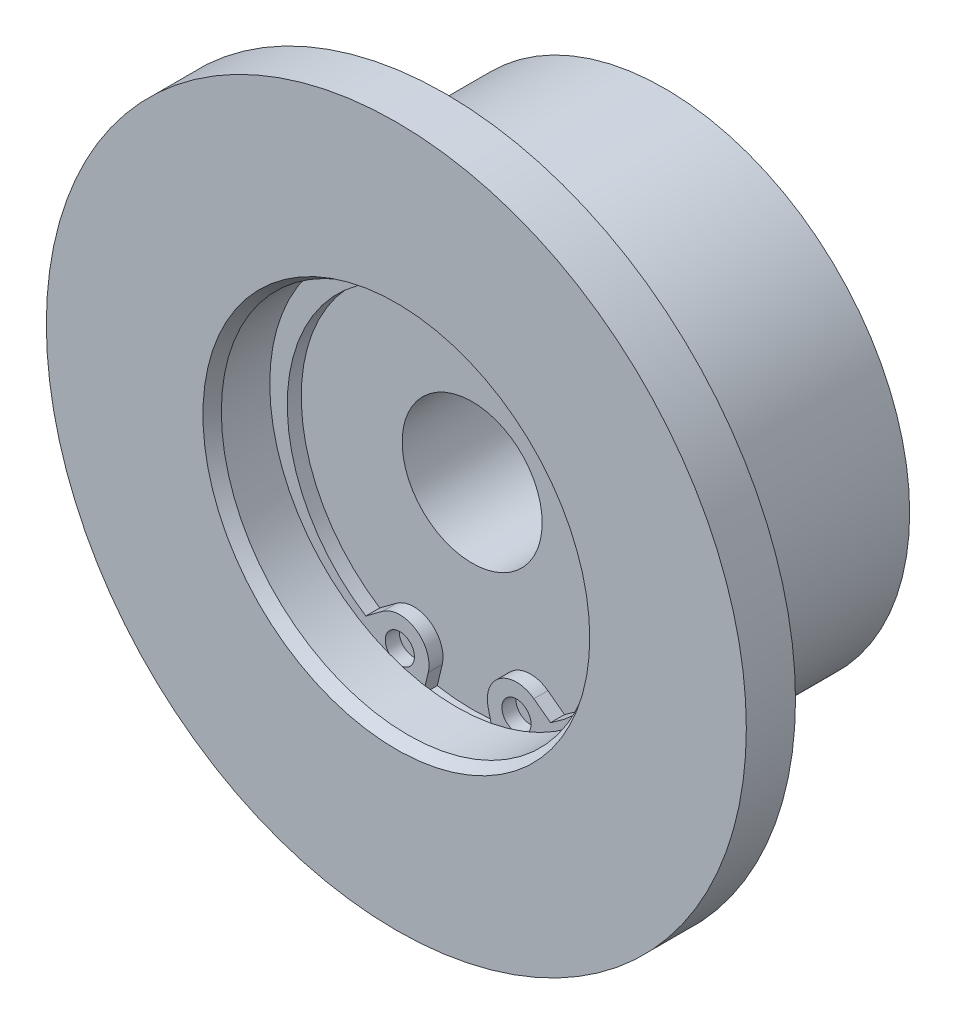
ISO-10303-21;
HEADER;
FILE_DESCRIPTION(('STEP AP214'),'2;1');
FILE_NAME('part.step','',(''),(''),'','','');
FILE_SCHEMA(('AUTOMOTIVE_DESIGN { 1 0 10303 214 1 1 1 1 }'));
ENDSEC;
DATA;
#1=APPLICATION_CONTEXT('core data for automotive mechanical design processes');
#2=APPLICATION_PROTOCOL_DEFINITION('international standard','automotive_design',2000,#1);
#3=PRODUCT_CONTEXT('',#1,'mechanical');
#4=PRODUCT('Part','Part','',(#3));
#5=PRODUCT_RELATED_PRODUCT_CATEGORY('part','',(#4));
#6=PRODUCT_DEFINITION_FORMATION('','',#4);
#7=PRODUCT_DEFINITION_CONTEXT('part definition',#1,'design');
#8=PRODUCT_DEFINITION('design','',#6,#7);
#9=PRODUCT_DEFINITION_SHAPE('','',#8);
#10=(LENGTH_UNIT() NAMED_UNIT(*) SI_UNIT(.MILLI.,.METRE.));
#11=(NAMED_UNIT(*) PLANE_ANGLE_UNIT() SI_UNIT($,.RADIAN.));
#12=(NAMED_UNIT(*) SI_UNIT($,.STERADIAN.) SOLID_ANGLE_UNIT());
#13=UNCERTAINTY_MEASURE_WITH_UNIT(LENGTH_MEASURE(1.E-05),#10,'distance_accuracy_value','');
#14=(GEOMETRIC_REPRESENTATION_CONTEXT(3) GLOBAL_UNCERTAINTY_ASSIGNED_CONTEXT((#13)) GLOBAL_UNIT_ASSIGNED_CONTEXT((#10,
#11,#12)) REPRESENTATION_CONTEXT('',''));
#15=CARTESIAN_POINT('',(0.,0.,0.));
#16=DIRECTION('',(0.,0.,1.));
#17=DIRECTION('',(1.,0.,0.));
#18=AXIS2_PLACEMENT_3D('',#15,#16,#17);
#19=CARTESIAN_POINT('',(0.,-0.95,6.2));
#20=DIRECTION('',(0.,0.,1.));
#21=DIRECTION('',(-1.,0.,0.));
#22=AXIS2_PLACEMENT_3D('',#19,#20,#21);
#23=CYLINDRICAL_SURFACE('',#22,14.65);
#24=CARTESIAN_POINT('',(0.,-0.95,5.));
#25=DIRECTION('',(0.,0.,-1.));
#26=DIRECTION('',(0.,-1.,0.));
#27=AXIS2_PLACEMENT_3D('',#24,#25,#26);
#28=CIRCLE('',#27,14.65);
#29=CARTESIAN_POINT('',(-7.91695293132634,-13.2765711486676,5.));
#30=VERTEX_POINT('',#29);
#31=CARTESIAN_POINT('',(7.91695293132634,-13.2765711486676,5.));
#32=VERTEX_POINT('',#31);
#33=EDGE_CURVE('E161',#30,#32,#28,.T.);
#34=ORIENTED_EDGE('',*,*,#33,.T.);
#35=DIRECTION('',(0.,0.,-1.));
#36=VECTOR('',#35,1.);
#37=CARTESIAN_POINT('',(7.91695293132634,-13.2765711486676,6.2));
#38=LINE('',#37,#36);
#39=CARTESIAN_POINT('',(7.91695293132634,-13.2765711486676,6.2));
#40=VERTEX_POINT('',#39);
#41=EDGE_CURVE('E101',#40,#32,#38,.T.);
#42=ORIENTED_EDGE('',*,*,#41,.F.);
#43=CARTESIAN_POINT('',(0.,-0.95,6.2));
#44=DIRECTION('',(0.,0.,-1.));
#45=DIRECTION('',(0.,-1.,0.));
#46=AXIS2_PLACEMENT_3D('',#43,#44,#45);
#47=CIRCLE('',#46,14.65);
#48=CARTESIAN_POINT('',(-7.91695293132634,-13.2765711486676,6.2));
#49=VERTEX_POINT('',#48);
#50=EDGE_CURVE('E102',#49,#40,#47,.T.);
#51=ORIENTED_EDGE('',*,*,#50,.F.);
#52=DIRECTION('',(0.,0.,-1.));
#53=VECTOR('',#52,1.);
#54=CARTESIAN_POINT('',(-7.91695293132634,-13.2765711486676,6.2));
#55=LINE('',#54,#53);
#56=EDGE_CURVE('E96',#49,#30,#55,.T.);
#57=ORIENTED_EDGE('',*,*,#56,.T.);
#58=EDGE_LOOP('',(#34,#42,#51,#57));
#59=FACE_BOUND('',#58,.T.);
#60=ADVANCED_FACE('F14',(#59),#23,.F.);
#61=CARTESIAN_POINT('',(6.49138441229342,-12.2169439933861,6.2));
#62=DIRECTION('',(-0.596553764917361,-0.802573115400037,0.));
#63=DIRECTION('',(-0.802573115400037,0.596553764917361,0.));
#64=AXIS2_PLACEMENT_3D('',#61,#62,#63);
#65=PLANE('',#64);
#66=DIRECTION('',(-0.802573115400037,0.596553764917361,0.));
#67=VECTOR('',#66,1.);
#68=CARTESIAN_POINT('',(6.49138441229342,-12.2169439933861,5.));
#69=LINE('',#68,#67);
#70=CARTESIAN_POINT('',(6.49138441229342,-12.2169439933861,5.));
#71=VERTEX_POINT('',#70);
#72=EDGE_CURVE('E145',#32,#71,#69,.T.);
#73=ORIENTED_EDGE('',*,*,#72,.T.);
#74=DIRECTION('',(0.,0.,-1.));
#75=VECTOR('',#74,1.);
#76=CARTESIAN_POINT('',(6.49138441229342,-12.2169439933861,6.2));
#77=LINE('',#76,#75);
#78=CARTESIAN_POINT('',(6.49138441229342,-12.2169439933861,6.2));
#79=VERTEX_POINT('',#78);
#80=EDGE_CURVE('E150',#79,#71,#77,.T.);
#81=ORIENTED_EDGE('',*,*,#80,.F.);
#82=DIRECTION('',(-0.802573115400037,0.596553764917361,0.));
#83=VECTOR('',#82,1.);
#84=CARTESIAN_POINT('',(6.49138441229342,-12.2169439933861,6.2));
#85=LINE('',#84,#83);
#86=EDGE_CURVE('E135',#40,#79,#85,.T.);
#87=ORIENTED_EDGE('',*,*,#86,.F.);
#88=ORIENTED_EDGE('',*,*,#41,.T.);
#89=EDGE_LOOP('',(#73,#81,#87,#88));
#90=FACE_BOUND('',#89,.T.);
#91=ADVANCED_FACE('F286',(#90),#65,.F.);
#92=CARTESIAN_POINT('',(5.,-14.2233767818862,6.2));
#93=DIRECTION('',(0.,0.,1.));
#94=DIRECTION('',(-1.,0.,0.));
#95=AXIS2_PLACEMENT_3D('',#92,#93,#94);
#96=CYLINDRICAL_SURFACE('',#95,2.5);
#97=CARTESIAN_POINT('',(5.,-14.2233767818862,5.));
#98=DIRECTION('',(0.,0.,1.));
#99=DIRECTION('',(1.,0.,0.));
#100=AXIS2_PLACEMENT_3D('',#97,#98,#99);
#101=CIRCLE('',#100,2.5);
#102=CARTESIAN_POINT('',(2.5678231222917,-14.8017500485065,5.));
#103=VERTEX_POINT('',#102);
#104=EDGE_CURVE('E131',#71,#103,#101,.T.);
#105=ORIENTED_EDGE('',*,*,#104,.T.);
#106=DIRECTION('',(0.,0.,-1.));
#107=VECTOR('',#106,1.);
#108=CARTESIAN_POINT('',(2.5678231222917,-14.8017500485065,6.2));
#109=LINE('',#108,#107);
#110=CARTESIAN_POINT('',(2.5678231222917,-14.8017500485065,6.2));
#111=VERTEX_POINT('',#110);
#112=EDGE_CURVE('E151',#111,#103,#109,.T.);
#113=ORIENTED_EDGE('',*,*,#112,.F.);
#114=CARTESIAN_POINT('',(5.,-14.2233767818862,6.2));
#115=DIRECTION('',(0.,0.,1.));
#116=DIRECTION('',(1.,0.,0.));
#117=AXIS2_PLACEMENT_3D('',#114,#115,#116);
#118=CIRCLE('',#117,2.5);
#119=EDGE_CURVE('E166',#79,#111,#118,.T.);
#120=ORIENTED_EDGE('',*,*,#119,.F.);
#121=ORIENTED_EDGE('',*,*,#80,.T.);
#122=EDGE_LOOP('',(#105,#113,#120,#121));
#123=FACE_BOUND('',#122,.T.);
#124=ADVANCED_FACE('F283',(#123),#96,.T.);
#125=CARTESIAN_POINT('',(-2.56782312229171,-14.8017500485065,6.2));
#126=DIRECTION('',(-0.97287075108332,0.231349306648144,0.));
#127=DIRECTION('',(0.,0.,1.));
#128=AXIS2_PLACEMENT_3D('',#125,#126,#127);
#129=PLANE('',#128);
#130=DIRECTION('',(0.,0.,1.));
#131=VECTOR('',#130,1.);
#132=CARTESIAN_POINT('',(-2.99125499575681,-16.5823669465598,20.1183293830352));
#133=LINE('',#132,#131);
#134=CARTESIAN_POINT('',(-2.99125499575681,-16.5823669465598,5.));
#135=VERTEX_POINT('',#134);
#136=CARTESIAN_POINT('',(-2.99125499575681,-16.5823669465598,6.2));
#137=VERTEX_POINT('',#136);
#138=EDGE_CURVE('E175',#135,#137,#133,.T.);
#139=ORIENTED_EDGE('',*,*,#138,.F.);
#140=DIRECTION('',(0.231349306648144,0.97287075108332,0.));
#141=VECTOR('',#140,1.);
#142=CARTESIAN_POINT('',(-2.56782312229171,-14.8017500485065,5.));
#143=LINE('',#142,#141);
#144=CARTESIAN_POINT('',(-2.56782312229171,-14.8017500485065,5.));
#145=VERTEX_POINT('',#144);
#146=EDGE_CURVE('E152',#135,#145,#143,.T.);
#147=ORIENTED_EDGE('',*,*,#146,.T.);
#148=DIRECTION('',(0.,0.,-1.));
#149=VECTOR('',#148,1.);
#150=CARTESIAN_POINT('',(-2.56782312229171,-14.8017500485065,6.2));
#151=LINE('',#150,#149);
#152=CARTESIAN_POINT('',(-2.56782312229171,-14.8017500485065,6.2));
#153=VERTEX_POINT('',#152);
#154=EDGE_CURVE('E171',#153,#145,#151,.T.);
#155=ORIENTED_EDGE('',*,*,#154,.F.);
#156=DIRECTION('',(0.231349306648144,0.97287075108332,0.));
#157=VECTOR('',#156,1.);
#158=CARTESIAN_POINT('',(-2.56782312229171,-14.8017500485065,6.2));
#159=LINE('',#158,#157);
#160=EDGE_CURVE('E119',#137,#153,#159,.T.);
#161=ORIENTED_EDGE('',*,*,#160,.F.);
#162=EDGE_LOOP('',(#139,#147,#155,#161));
#163=FACE_BOUND('',#162,.T.);
#164=ADVANCED_FACE('F296',(#163),#129,.F.);
#165=CARTESIAN_POINT('',(0.,-0.95,6.2));
#166=DIRECTION('',(0.,0.,-1.));
#167=DIRECTION('',(0.,-1.,0.));
#168=AXIS2_PLACEMENT_3D('',#165,#166,#167);
#169=PLANE('',#168);
#170=CARTESIAN_POINT('',(5.,-14.2233767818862,6.2));
#171=DIRECTION('',(0.,0.,1.));
#172=DIRECTION('',(1.,0.,0.));
#173=AXIS2_PLACEMENT_3D('',#170,#171,#172);
#174=CIRCLE('',#173,1.25);
#175=CARTESIAN_POINT('',(6.25,-14.2233767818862,6.2));
#176=VERTEX_POINT('',#175);
#177=EDGE_CURVE('E137',#176,#176,#174,.T.);
#178=ORIENTED_EDGE('',*,*,#177,.F.);
#179=EDGE_LOOP('',(#178));
#180=FACE_BOUND('',#179,.T.);
#181=CARTESIAN_POINT('',(-5.,-14.2233767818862,6.2));
#182=DIRECTION('',(0.,0.,-1.));
#183=DIRECTION('',(1.,0.,0.));
#184=AXIS2_PLACEMENT_3D('',#181,#182,#183);
#185=CIRCLE('',#184,1.25);
#186=CARTESIAN_POINT('',(-3.75,-14.2233767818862,6.2));
#187=VERTEX_POINT('',#186);
#188=EDGE_CURVE('E121',#187,#187,#185,.T.);
#189=ORIENTED_EDGE('',*,*,#188,.T.);
#190=EDGE_LOOP('',(#189));
#191=FACE_BOUND('',#190,.T.);
#192=CARTESIAN_POINT('',(0.,0.,6.2));
#193=DIRECTION('',(0.,0.,-1.));
#194=DIRECTION('',(-1.,0.,0.));
#195=AXIS2_PLACEMENT_3D('',#192,#193,#194);
#196=CIRCLE('',#195,16.85);
#197=CARTESIAN_POINT('',(2.99125499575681,-16.5823669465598,6.2));
#198=VERTEX_POINT('',#197);
#199=EDGE_CURVE('E9',#137,#198,#196,.T.);
#200=ORIENTED_EDGE('',*,*,#199,.F.);
#201=ORIENTED_EDGE('',*,*,#160,.T.);
#202=CARTESIAN_POINT('',(-5.,-14.2233767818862,6.2));
#203=DIRECTION('',(0.,0.,1.));
#204=DIRECTION('',(-1.,0.,0.));
#205=AXIS2_PLACEMENT_3D('',#202,#203,#204);
#206=CIRCLE('',#205,2.5);
#207=CARTESIAN_POINT('',(-6.49138441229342,-12.2169439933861,6.2));
#208=VERTEX_POINT('',#207);
#209=EDGE_CURVE('E108',#153,#208,#206,.T.);
#210=ORIENTED_EDGE('',*,*,#209,.T.);
#211=DIRECTION('',(-0.802573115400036,-0.596553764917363,0.));
#212=VECTOR('',#211,1.);
#213=CARTESIAN_POINT('',(-6.49138441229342,-12.2169439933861,6.2));
#214=LINE('',#213,#212);
#215=EDGE_CURVE('E91',#208,#49,#214,.T.);
#216=ORIENTED_EDGE('',*,*,#215,.T.);
#217=ORIENTED_EDGE('',*,*,#50,.T.);
#218=ORIENTED_EDGE('',*,*,#86,.T.);
#219=ORIENTED_EDGE('',*,*,#119,.T.);
#220=DIRECTION('',(0.231349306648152,-0.972870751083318,0.));
#221=VECTOR('',#220,1.);
#222=CARTESIAN_POINT('',(2.5678231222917,-14.8017500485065,6.2));
#223=LINE('',#222,#221);
#224=EDGE_CURVE('E127',#111,#198,#223,.T.);
#225=ORIENTED_EDGE('',*,*,#224,.T.);
#226=EDGE_LOOP('',(#200,#201,#210,#216,#217,#218,#219,#225));
#227=FACE_BOUND('',#226,.T.);
#228=ADVANCED_FACE('F117',(#180,#191,#227),#169,.F.);
#229=CARTESIAN_POINT('',(5.,-14.2233767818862,6.2));
#230=DIRECTION('',(0.,0.,1.));
#231=DIRECTION('',(-1.,0.,0.));
#232=AXIS2_PLACEMENT_3D('',#229,#230,#231);
#233=CYLINDRICAL_SURFACE('',#232,1.25);
#234=CARTESIAN_POINT('',(5.,-14.2233767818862,5.));
#235=DIRECTION('',(0.,0.,1.));
#236=DIRECTION('',(1.,0.,0.));
#237=AXIS2_PLACEMENT_3D('',#234,#235,#236);
#238=CIRCLE('',#237,1.25);
#239=CARTESIAN_POINT('',(6.25,-14.2233767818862,5.));
#240=VERTEX_POINT('',#239);
#241=EDGE_CURVE('E114',#240,#240,#238,.T.);
#242=ORIENTED_EDGE('',*,*,#241,.F.);
#243=EDGE_LOOP('',(#242));
#244=FACE_BOUND('',#243,.T.);
#245=ORIENTED_EDGE('',*,*,#177,.T.);
#246=EDGE_LOOP('',(#245));
#247=FACE_BOUND('',#246,.T.);
#248=ADVANCED_FACE('F304',(#244,#247),#233,.F.);
#249=CARTESIAN_POINT('',(-5.,-14.2233767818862,6.2));
#250=DIRECTION('',(0.,0.,1.));
#251=DIRECTION('',(-1.,0.,0.));
#252=AXIS2_PLACEMENT_3D('',#249,#250,#251);
#253=CYLINDRICAL_SURFACE('',#252,1.25);
#254=CARTESIAN_POINT('',(-5.,-14.2233767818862,5.));
#255=DIRECTION('',(0.,0.,-1.));
#256=DIRECTION('',(1.,0.,0.));
#257=AXIS2_PLACEMENT_3D('',#254,#255,#256);
#258=CIRCLE('',#257,1.25);
#259=CARTESIAN_POINT('',(-3.75,-14.2233767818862,5.));
#260=VERTEX_POINT('',#259);
#261=EDGE_CURVE('E140',#260,#260,#258,.T.);
#262=ORIENTED_EDGE('',*,*,#261,.T.);
#263=EDGE_LOOP('',(#262));
#264=FACE_BOUND('',#263,.T.);
#265=ORIENTED_EDGE('',*,*,#188,.F.);
#266=EDGE_LOOP('',(#265));
#267=FACE_BOUND('',#266,.T.);
#268=ADVANCED_FACE('F326',(#264,#267),#253,.F.);
#269=CARTESIAN_POINT('',(-6.49138441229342,-12.2169439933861,6.2));
#270=DIRECTION('',(0.596553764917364,-0.802573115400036,0.));
#271=DIRECTION('',(0.,0.,-1.));
#272=AXIS2_PLACEMENT_3D('',#269,#270,#271);
#273=PLANE('',#272);
#274=DIRECTION('',(-0.802573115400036,-0.596553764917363,0.));
#275=VECTOR('',#274,1.);
#276=CARTESIAN_POINT('',(-6.49138441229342,-12.2169439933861,5.));
#277=LINE('',#276,#275);
#278=CARTESIAN_POINT('',(-6.49138441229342,-12.2169439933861,5.));
#279=VERTEX_POINT('',#278);
#280=EDGE_CURVE('E113',#279,#30,#277,.T.);
#281=ORIENTED_EDGE('',*,*,#280,.T.);
#282=ORIENTED_EDGE('',*,*,#56,.F.);
#283=ORIENTED_EDGE('',*,*,#215,.F.);
#284=DIRECTION('',(0.,0.,-1.));
#285=VECTOR('',#284,1.);
#286=CARTESIAN_POINT('',(-6.49138441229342,-12.2169439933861,6.2));
#287=LINE('',#286,#285);
#288=EDGE_CURVE('E94',#208,#279,#287,.T.);
#289=ORIENTED_EDGE('',*,*,#288,.T.);
#290=EDGE_LOOP('',(#281,#282,#283,#289));
#291=FACE_BOUND('',#290,.T.);
#292=ADVANCED_FACE('F93',(#291),#273,.F.);
#293=CARTESIAN_POINT('',(-5.,-14.2233767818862,6.2));
#294=DIRECTION('',(0.,0.,1.));
#295=DIRECTION('',(-1.,0.,0.));
#296=AXIS2_PLACEMENT_3D('',#293,#294,#295);
#297=CYLINDRICAL_SURFACE('',#296,2.5);
#298=CARTESIAN_POINT('',(-5.,-14.2233767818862,5.));
#299=DIRECTION('',(0.,0.,1.));
#300=DIRECTION('',(-1.,0.,0.));
#301=AXIS2_PLACEMENT_3D('',#298,#299,#300);
#302=CIRCLE('',#301,2.5);
#303=EDGE_CURVE('E110',#145,#279,#302,.T.);
#304=ORIENTED_EDGE('',*,*,#303,.T.);
#305=ORIENTED_EDGE('',*,*,#288,.F.);
#306=ORIENTED_EDGE('',*,*,#209,.F.);
#307=ORIENTED_EDGE('',*,*,#154,.T.);
#308=EDGE_LOOP('',(#304,#305,#306,#307));
#309=FACE_BOUND('',#308,.T.);
#310=ADVANCED_FACE('F106',(#309),#297,.T.);
#311=CARTESIAN_POINT('',(2.5678231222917,-14.8017500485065,6.2));
#312=DIRECTION('',(0.972870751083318,0.231349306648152,0.));
#313=DIRECTION('',(0.,0.,-1.));
#314=AXIS2_PLACEMENT_3D('',#311,#312,#313);
#315=PLANE('',#314);
#316=DIRECTION('',(0.,0.,1.));
#317=VECTOR('',#316,1.);
#318=CARTESIAN_POINT('',(2.99125499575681,-16.5823669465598,20.1183293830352));
#319=LINE('',#318,#317);
#320=CARTESIAN_POINT('',(2.99125499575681,-16.5823669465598,5.));
#321=VERTEX_POINT('',#320);
#322=EDGE_CURVE('E18',#198,#321,#319,.F.);
#323=ORIENTED_EDGE('',*,*,#322,.F.);
#324=ORIENTED_EDGE('',*,*,#224,.F.);
#325=ORIENTED_EDGE('',*,*,#112,.T.);
#326=DIRECTION('',(0.231349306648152,-0.972870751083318,0.));
#327=VECTOR('',#326,1.);
#328=CARTESIAN_POINT('',(2.5678231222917,-14.8017500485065,5.));
#329=LINE('',#328,#327);
#330=EDGE_CURVE('E32',#103,#321,#329,.T.);
#331=ORIENTED_EDGE('',*,*,#330,.T.);
#332=EDGE_LOOP('',(#323,#324,#325,#331));
#333=FACE_BOUND('',#332,.T.);
#334=ADVANCED_FACE('F265',(#333),#315,.F.);
#335=CARTESIAN_POINT('',(0.,6.,5.));
#336=DIRECTION('',(0.,0.,-1.));
#337=DIRECTION('',(-1.,0.,0.));
#338=AXIS2_PLACEMENT_3D('',#335,#336,#337);
#339=PLANE('',#338);
#340=ORIENTED_EDGE('',*,*,#241,.T.);
#341=EDGE_LOOP('',(#340));
#342=FACE_BOUND('',#341,.T.);
#343=ADVANCED_FACE('F257',(#342),#339,.F.);
#344=ORIENTED_EDGE('',*,*,#261,.F.);
#345=EDGE_LOOP('',(#344));
#346=FACE_BOUND('',#345,.T.);
#347=ADVANCED_FACE('F256',(#346),#339,.F.);
#348=CARTESIAN_POINT('',(0.,0.,6.5));
#349=DIRECTION('',(0.,0.,1.));
#350=DIRECTION('',(1.,0.,0.));
#351=AXIS2_PLACEMENT_3D('',#348,#349,#350);
#352=CONICAL_SURFACE('',#351,21.,1.48352986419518);
#353=CARTESIAN_POINT('',(0.,0.,7.2873979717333));
#354=DIRECTION('',(0.,0.,1.));
#355=DIRECTION('',(1.,0.,0.));
#356=AXIS2_PLACEMENT_3D('',#353,#354,#355);
#357=CIRCLE('',#356,30.);
#358=CARTESIAN_POINT('',(30.,0.,7.2873979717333));
#359=VERTEX_POINT('',#358);
#360=EDGE_CURVE('E210',#359,#359,#357,.T.);
#361=ORIENTED_EDGE('',*,*,#360,.F.);
#362=EDGE_LOOP('',(#361));
#363=FACE_BOUND('',#362,.T.);
#364=CARTESIAN_POINT('',(0.,0.,6.5));
#365=DIRECTION('',(0.,0.,1.));
#366=DIRECTION('',(1.,0.,0.));
#367=AXIS2_PLACEMENT_3D('',#364,#365,#366);
#368=CIRCLE('',#367,21.);
#369=CARTESIAN_POINT('',(21.,0.,6.5));
#370=VERTEX_POINT('',#369);
#371=EDGE_CURVE('E141',#370,#370,#368,.T.);
#372=ORIENTED_EDGE('',*,*,#371,.T.);
#373=EDGE_LOOP('',(#372));
#374=FACE_BOUND('',#373,.T.);
#375=ADVANCED_FACE('F216',(#363,#374),#352,.T.);
#376=CARTESIAN_POINT('',(0.,0.,20.1183293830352));
#377=DIRECTION('',(0.,0.,1.));
#378=DIRECTION('',(1.,0.,0.));
#379=AXIS2_PLACEMENT_3D('',#376,#377,#378);
#380=CYLINDRICAL_SURFACE('',#379,30.);
#381=CARTESIAN_POINT('',(0.,0.,11.5));
#382=DIRECTION('',(0.,0.,1.));
#383=DIRECTION('',(1.,0.,0.));
#384=AXIS2_PLACEMENT_3D('',#381,#382,#383);
#385=CIRCLE('',#384,30.);
#386=CARTESIAN_POINT('',(30.,0.,11.5));
#387=VERTEX_POINT('',#386);
#388=EDGE_CURVE('E207',#387,#387,#385,.T.);
#389=ORIENTED_EDGE('',*,*,#388,.F.);
#390=EDGE_LOOP('',(#389));
#391=FACE_BOUND('',#390,.T.);
#392=ORIENTED_EDGE('',*,*,#360,.T.);
#393=EDGE_LOOP('',(#392));
#394=FACE_BOUND('',#393,.T.);
#395=ADVANCED_FACE('F221',(#391,#394),#380,.T.);
#396=CARTESIAN_POINT('',(0.,0.,20.1183293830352));
#397=DIRECTION('',(0.,0.,1.));
#398=DIRECTION('',(1.,0.,0.));
#399=AXIS2_PLACEMENT_3D('',#396,#397,#398);
#400=CYLINDRICAL_SURFACE('',#399,21.);
#401=ORIENTED_EDGE('',*,*,#371,.F.);
#402=EDGE_LOOP('',(#401));
#403=FACE_BOUND('',#402,.T.);
#404=CARTESIAN_POINT('',(0.,0.,-11.5));
#405=DIRECTION('',(0.,0.,1.));
#406=DIRECTION('',(1.,0.,0.));
#407=AXIS2_PLACEMENT_3D('',#404,#405,#406);
#408=CIRCLE('',#407,21.);
#409=CARTESIAN_POINT('',(21.,0.,-11.5));
#410=VERTEX_POINT('',#409);
#411=EDGE_CURVE('E177',#410,#410,#408,.T.);
#412=ORIENTED_EDGE('',*,*,#411,.T.);
#413=EDGE_LOOP('',(#412));
#414=FACE_BOUND('',#413,.T.);
#415=ADVANCED_FACE('F16',(#403,#414),#400,.T.);
#416=CARTESIAN_POINT('',(0.,30.,11.5));
#417=DIRECTION('',(0.,0.,-1.));
#418=DIRECTION('',(-1.,0.,0.));
#419=AXIS2_PLACEMENT_3D('',#416,#417,#418);
#420=PLANE('',#419);
#421=CARTESIAN_POINT('',(0.,0.,11.5));
#422=DIRECTION('',(0.,0.,1.));
#423=DIRECTION('',(1.,0.,0.));
#424=AXIS2_PLACEMENT_3D('',#421,#422,#423);
#425=CIRCLE('',#424,16.5773502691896);
#426=CARTESIAN_POINT('',(16.5773502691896,0.,11.5));
#427=VERTEX_POINT('',#426);
#428=EDGE_CURVE('E204',#427,#427,#425,.T.);
#429=ORIENTED_EDGE('',*,*,#428,.F.);
#430=EDGE_LOOP('',(#429));
#431=FACE_BOUND('',#430,.T.);
#432=ORIENTED_EDGE('',*,*,#388,.T.);
#433=EDGE_LOOP('',(#432));
#434=FACE_BOUND('',#433,.T.);
#435=ADVANCED_FACE('F220',(#431,#434),#420,.F.);
#436=CARTESIAN_POINT('',(0.,13.,-11.5));
#437=DIRECTION('',(0.,0.,1.));
#438=DIRECTION('',(1.,0.,0.));
#439=AXIS2_PLACEMENT_3D('',#436,#437,#438);
#440=PLANE('',#439);
#441=ORIENTED_EDGE('',*,*,#411,.F.);
#442=EDGE_LOOP('',(#441));
#443=FACE_BOUND('',#442,.T.);
#444=CARTESIAN_POINT('',(0.,0.,-11.5));
#445=DIRECTION('',(0.,0.,1.));
#446=DIRECTION('',(1.,0.,0.));
#447=AXIS2_PLACEMENT_3D('',#444,#445,#446);
#448=CIRCLE('',#447,13.);
#449=CARTESIAN_POINT('',(13.,0.,-11.5));
#450=VERTEX_POINT('',#449);
#451=EDGE_CURVE('E180',#450,#450,#448,.T.);
#452=ORIENTED_EDGE('',*,*,#451,.T.);
#453=EDGE_LOOP('',(#452));
#454=FACE_BOUND('',#453,.T.);
#455=ADVANCED_FACE('F224',(#443,#454),#440,.F.);
#456=CARTESIAN_POINT('',(0.,0.,11.5));
#457=DIRECTION('',(0.,0.,1.));
#458=DIRECTION('',(1.,0.,0.));
#459=AXIS2_PLACEMENT_3D('',#456,#457,#458);
#460=CONICAL_SURFACE('',#459,16.5773502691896,0.523598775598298);
#461=CARTESIAN_POINT('',(0.,0.,10.5));
#462=DIRECTION('',(0.,0.,1.));
#463=DIRECTION('',(1.,0.,0.));
#464=AXIS2_PLACEMENT_3D('',#461,#462,#463);
#465=CIRCLE('',#464,16.);
#466=CARTESIAN_POINT('',(16.,0.,10.5));
#467=VERTEX_POINT('',#466);
#468=EDGE_CURVE('E201',#467,#467,#465,.T.);
#469=ORIENTED_EDGE('',*,*,#468,.F.);
#470=EDGE_LOOP('',(#469));
#471=FACE_BOUND('',#470,.T.);
#472=ORIENTED_EDGE('',*,*,#428,.T.);
#473=EDGE_LOOP('',(#472));
#474=FACE_BOUND('',#473,.T.);
#475=ADVANCED_FACE('F227',(#471,#474),#460,.F.);
#476=CARTESIAN_POINT('',(0.,0.,20.1183293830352));
#477=DIRECTION('',(0.,0.,1.));
#478=DIRECTION('',(1.,0.,0.));
#479=AXIS2_PLACEMENT_3D('',#476,#477,#478);
#480=CYLINDRICAL_SURFACE('',#479,13.);
#481=ORIENTED_EDGE('',*,*,#451,.F.);
#482=EDGE_LOOP('',(#481));
#483=FACE_BOUND('',#482,.T.);
#484=CARTESIAN_POINT('',(0.,0.,-5.));
#485=DIRECTION('',(0.,0.,1.));
#486=DIRECTION('',(1.,0.,0.));
#487=AXIS2_PLACEMENT_3D('',#484,#485,#486);
#488=CIRCLE('',#487,13.);
#489=CARTESIAN_POINT('',(13.,0.,-5.));
#490=VERTEX_POINT('',#489);
#491=EDGE_CURVE('E183',#490,#490,#488,.T.);
#492=ORIENTED_EDGE('',*,*,#491,.T.);
#493=EDGE_LOOP('',(#492));
#494=FACE_BOUND('',#493,.T.);
#495=ADVANCED_FACE('F231',(#483,#494),#480,.F.);
#496=CARTESIAN_POINT('',(0.,0.,20.1183293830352));
#497=DIRECTION('',(0.,0.,1.));
#498=DIRECTION('',(1.,0.,0.));
#499=AXIS2_PLACEMENT_3D('',#496,#497,#498);
#500=CYLINDRICAL_SURFACE('',#499,16.);
#501=CARTESIAN_POINT('',(0.,0.,6.35));
#502=DIRECTION('',(0.,0.,1.));
#503=DIRECTION('',(1.,0.,0.));
#504=AXIS2_PLACEMENT_3D('',#501,#502,#503);
#505=CIRCLE('',#504,16.);
#506=CARTESIAN_POINT('',(16.,0.,6.35));
#507=VERTEX_POINT('',#506);
#508=EDGE_CURVE('E198',#507,#507,#505,.T.);
#509=ORIENTED_EDGE('',*,*,#508,.F.);
#510=EDGE_LOOP('',(#509));
#511=FACE_BOUND('',#510,.T.);
#512=ORIENTED_EDGE('',*,*,#468,.T.);
#513=EDGE_LOOP('',(#512));
#514=FACE_BOUND('',#513,.T.);
#515=ADVANCED_FACE('F234',(#511,#514),#500,.F.);
#516=CARTESIAN_POINT('',(0.,13.,-5.));
#517=DIRECTION('',(0.,0.,1.));
#518=DIRECTION('',(1.,0.,0.));
#519=AXIS2_PLACEMENT_3D('',#516,#517,#518);
#520=PLANE('',#519);
#521=ORIENTED_EDGE('',*,*,#491,.F.);
#522=EDGE_LOOP('',(#521));
#523=FACE_BOUND('',#522,.T.);
#524=CARTESIAN_POINT('',(0.,0.,-5.));
#525=DIRECTION('',(0.,0.,1.));
#526=DIRECTION('',(1.,0.,0.));
#527=AXIS2_PLACEMENT_3D('',#524,#525,#526);
#528=CIRCLE('',#527,6.);
#529=CARTESIAN_POINT('',(6.,0.,-5.));
#530=VERTEX_POINT('',#529);
#531=EDGE_CURVE('E186',#530,#530,#528,.T.);
#532=ORIENTED_EDGE('',*,*,#531,.T.);
#533=EDGE_LOOP('',(#532));
#534=FACE_BOUND('',#533,.T.);
#535=ADVANCED_FACE('F238',(#523,#534),#520,.F.);
#536=CARTESIAN_POINT('',(0.,16.85,6.35));
#537=DIRECTION('',(0.,0.,1.));
#538=DIRECTION('',(1.,0.,0.));
#539=AXIS2_PLACEMENT_3D('',#536,#537,#538);
#540=PLANE('',#539);
#541=CARTESIAN_POINT('',(0.,0.,6.35));
#542=DIRECTION('',(0.,0.,1.));
#543=DIRECTION('',(1.,0.,0.));
#544=AXIS2_PLACEMENT_3D('',#541,#542,#543);
#545=CIRCLE('',#544,16.85);
#546=CARTESIAN_POINT('',(16.85,0.,6.35));
#547=VERTEX_POINT('',#546);
#548=EDGE_CURVE('E195',#547,#547,#545,.T.);
#549=ORIENTED_EDGE('',*,*,#548,.F.);
#550=EDGE_LOOP('',(#549));
#551=FACE_BOUND('',#550,.T.);
#552=ORIENTED_EDGE('',*,*,#508,.T.);
#553=EDGE_LOOP('',(#552));
#554=FACE_BOUND('',#553,.T.);
#555=ADVANCED_FACE('F241',(#551,#554),#540,.F.);
#556=CARTESIAN_POINT('',(0.,0.,20.1183293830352));
#557=DIRECTION('',(0.,0.,1.));
#558=DIRECTION('',(1.,0.,0.));
#559=AXIS2_PLACEMENT_3D('',#556,#557,#558);
#560=CYLINDRICAL_SURFACE('',#559,16.85);
#561=ORIENTED_EDGE('',*,*,#548,.T.);
#562=EDGE_LOOP('',(#561));
#563=FACE_BOUND('',#562,.T.);
#564=ORIENTED_EDGE('',*,*,#199,.T.);
#565=ORIENTED_EDGE('',*,*,#322,.T.);
#566=CARTESIAN_POINT('',(0.,0.,5.));
#567=DIRECTION('',(0.,0.,1.));
#568=DIRECTION('',(1.,0.,0.));
#569=AXIS2_PLACEMENT_3D('',#566,#567,#568);
#570=CIRCLE('',#569,16.85);
#571=EDGE_CURVE('E192',#135,#321,#570,.T.);
#572=ORIENTED_EDGE('',*,*,#571,.F.);
#573=ORIENTED_EDGE('',*,*,#138,.T.);
#574=EDGE_LOOP('',(#564,#565,#572,#573));
#575=FACE_BOUND('',#574,.T.);
#576=ADVANCED_FACE('F249',(#563,#575),#560,.F.);
#577=CARTESIAN_POINT('',(0.,0.,20.1183293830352));
#578=DIRECTION('',(0.,0.,1.));
#579=DIRECTION('',(1.,0.,0.));
#580=AXIS2_PLACEMENT_3D('',#577,#578,#579);
#581=CYLINDRICAL_SURFACE('',#580,6.);
#582=ORIENTED_EDGE('',*,*,#531,.F.);
#583=EDGE_LOOP('',(#582));
#584=FACE_BOUND('',#583,.T.);
#585=CARTESIAN_POINT('',(0.,0.,5.));
#586=DIRECTION('',(0.,0.,1.));
#587=DIRECTION('',(1.,0.,0.));
#588=AXIS2_PLACEMENT_3D('',#585,#586,#587);
#589=CIRCLE('',#588,6.);
#590=CARTESIAN_POINT('',(6.,0.,5.));
#591=VERTEX_POINT('',#590);
#592=EDGE_CURVE('E189',#591,#591,#589,.T.);
#593=ORIENTED_EDGE('',*,*,#592,.T.);
#594=EDGE_LOOP('',(#593));
#595=FACE_BOUND('',#594,.T.);
#596=ADVANCED_FACE('F245',(#584,#595),#581,.F.);
#597=ORIENTED_EDGE('',*,*,#592,.F.);
#598=EDGE_LOOP('',(#597));
#599=FACE_BOUND('',#598,.T.);
#600=ORIENTED_EDGE('',*,*,#571,.T.);
#601=ORIENTED_EDGE('',*,*,#330,.F.);
#602=ORIENTED_EDGE('',*,*,#104,.F.);
#603=ORIENTED_EDGE('',*,*,#72,.F.);
#604=ORIENTED_EDGE('',*,*,#33,.F.);
#605=ORIENTED_EDGE('',*,*,#280,.F.);
#606=ORIENTED_EDGE('',*,*,#303,.F.);
#607=ORIENTED_EDGE('',*,*,#146,.F.);
#608=EDGE_LOOP('',(#600,#601,#602,#603,#604,#605,#606,#607));
#609=FACE_BOUND('',#608,.T.);
#610=ADVANCED_FACE('F248',(#599,#609),#339,.F.);
#611=CLOSED_SHELL('',(#60,#91,#124,#164,#228,#248,#268,#292,#310,#334,#343,#347,#375,#395,#415,
#435,#455,#475,#495,#515,#535,#555,#576,#596,#610));
#612=MANIFOLD_SOLID_BREP('B1',#611);
#613=ADVANCED_BREP_SHAPE_REPRESENTATION('',(#18,#612),#14);
#614=SHAPE_DEFINITION_REPRESENTATION(#9,#613);
ENDSEC;
END-ISO-10303-21;
